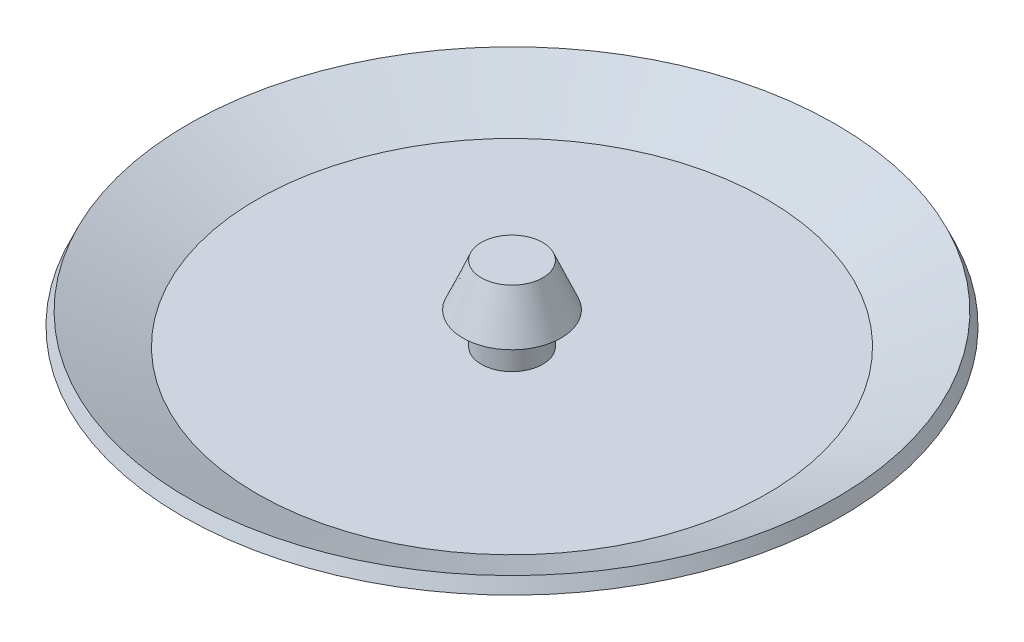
from build123d import *

# Parameters (mm, degrees)
CUT_EXTRUDE1_DEPTH      = 26.275067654
CUT_EXTRUDE1_DEPTH_BACK = 26.275067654
SKETCH3_W               = 2.54
SKETCH3_H               = 12.7


with BuildPart() as part:
    # Sketch2 → Base-Revolve (revolve)
    with BuildSketch(Plane.XY, mode=Mode.PRIVATE) as base_revolve_sk:
        Polygon((0, 0), (0, 16.3322), (1.27, 16.3322), (1.27, 3.6322), (2.032, 1.8542), (1.27, 1.8542), (1.27, 0.531702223), (10.552917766, 0.531702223), (13.401945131, 1.801702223), (13.6398, 1.268115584), (10.795, 0), align=None)
    revolve(base_revolve_sk.sketch.rotate(Axis((0, 0, 0), (0, 1, 0)), 90), axis=Axis((0, 0, 0), (0, 1, 0)))

    # Sketch3 → Cut-Extrude1 (cut, two sides: drawn at the far end of the back side and taken through both)
    with BuildSketch(Plane.XY.offset(-CUT_EXTRUDE1_DEPTH_BACK)):
        with Locations((0, 9.9822)):
            Rectangle(SKETCH3_W, SKETCH3_H)
    extrude(amount=CUT_EXTRUDE1_DEPTH + CUT_EXTRUDE1_DEPTH_BACK, mode=Mode.SUBTRACT)


solid = part.part
